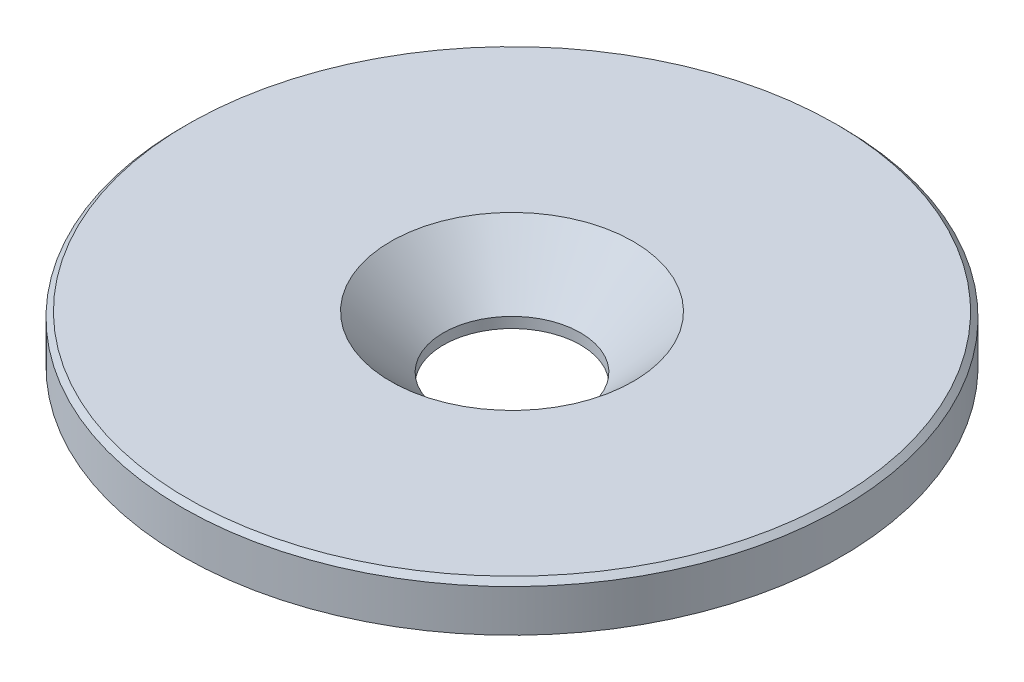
ISO-10303-21;
HEADER;
FILE_DESCRIPTION(('STEP AP214'),'2;1');
FILE_NAME('part.step','',(''),(''),'','','');
FILE_SCHEMA(('AUTOMOTIVE_DESIGN { 1 0 10303 214 1 1 1 1 }'));
ENDSEC;
DATA;
#1=APPLICATION_CONTEXT('core data for automotive mechanical design processes');
#2=APPLICATION_PROTOCOL_DEFINITION('international standard','automotive_design',2000,#1);
#3=PRODUCT_CONTEXT('',#1,'mechanical');
#4=PRODUCT('Part','Part','',(#3));
#5=PRODUCT_RELATED_PRODUCT_CATEGORY('part','',(#4));
#6=PRODUCT_DEFINITION_FORMATION('','',#4);
#7=PRODUCT_DEFINITION_CONTEXT('part definition',#1,'design');
#8=PRODUCT_DEFINITION('design','',#6,#7);
#9=PRODUCT_DEFINITION_SHAPE('','',#8);
#10=(LENGTH_UNIT() NAMED_UNIT(*) SI_UNIT(.MILLI.,.METRE.));
#11=(NAMED_UNIT(*) PLANE_ANGLE_UNIT() SI_UNIT($,.RADIAN.));
#12=(NAMED_UNIT(*) SI_UNIT($,.STERADIAN.) SOLID_ANGLE_UNIT());
#13=UNCERTAINTY_MEASURE_WITH_UNIT(LENGTH_MEASURE(1.E-05),#10,'distance_accuracy_value','');
#14=(GEOMETRIC_REPRESENTATION_CONTEXT(3) GLOBAL_UNCERTAINTY_ASSIGNED_CONTEXT((#13)) GLOBAL_UNIT_ASSIGNED_CONTEXT((#10,
#11,#12)) REPRESENTATION_CONTEXT('',''));
#15=CARTESIAN_POINT('',(0.,0.,0.));
#16=DIRECTION('',(0.,0.,1.));
#17=DIRECTION('',(1.,0.,0.));
#18=AXIS2_PLACEMENT_3D('',#15,#16,#17);
#19=CARTESIAN_POINT('',(0.,0.,0.));
#20=DIRECTION('',(0.,-1.,0.));
#21=DIRECTION('',(0.,0.,-1.));
#22=AXIS2_PLACEMENT_3D('',#19,#20,#21);
#23=CYLINDRICAL_SURFACE('',#22,13.);
#24=CARTESIAN_POINT('',(0.,2.,0.));
#25=DIRECTION('',(0.,-1.,0.));
#26=DIRECTION('',(0.,0.,-1.));
#27=AXIS2_PLACEMENT_3D('',#24,#25,#26);
#28=CIRCLE('',#27,13.);
#29=CARTESIAN_POINT('',(0.,2.,-13.));
#30=VERTEX_POINT('',#29);
#31=EDGE_CURVE('E34',#30,#30,#28,.T.);
#32=ORIENTED_EDGE('',*,*,#31,.F.);
#33=EDGE_LOOP('',(#32));
#34=FACE_BOUND('',#33,.T.);
#35=CARTESIAN_POINT('',(0.,0.,0.));
#36=DIRECTION('',(0.,-1.,0.));
#37=DIRECTION('',(0.,0.,-1.));
#38=AXIS2_PLACEMENT_3D('',#35,#36,#37);
#39=CIRCLE('',#38,13.);
#40=CARTESIAN_POINT('',(0.,0.,-13.));
#41=VERTEX_POINT('',#40);
#42=EDGE_CURVE('E46',#41,#41,#39,.T.);
#43=ORIENTED_EDGE('',*,*,#42,.T.);
#44=EDGE_LOOP('',(#43));
#45=FACE_BOUND('',#44,.T.);
#46=ADVANCED_FACE('F14',(#34,#45),#23,.F.);
#47=CARTESIAN_POINT('',(0.,2.,0.));
#48=DIRECTION('',(0.,1.,0.));
#49=DIRECTION('',(0.,0.,1.));
#50=AXIS2_PLACEMENT_3D('',#47,#48,#49);
#51=CONICAL_SURFACE('',#50,13.,0.78539816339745);
#52=CARTESIAN_POINT('',(0.,12.,0.));
#53=DIRECTION('',(0.,-1.,0.));
#54=DIRECTION('',(0.,0.,-1.));
#55=AXIS2_PLACEMENT_3D('',#52,#53,#54);
#56=CIRCLE('',#55,23.);
#57=CARTESIAN_POINT('',(0.,12.,-23.));
#58=VERTEX_POINT('',#57);
#59=EDGE_CURVE('E37',#58,#58,#56,.T.);
#60=ORIENTED_EDGE('',*,*,#59,.F.);
#61=EDGE_LOOP('',(#60));
#62=FACE_BOUND('',#61,.T.);
#63=ORIENTED_EDGE('',*,*,#31,.T.);
#64=EDGE_LOOP('',(#63));
#65=FACE_BOUND('',#64,.T.);
#66=ADVANCED_FACE('F68',(#62,#65),#51,.F.);
#67=CARTESIAN_POINT('',(-23.,12.,0.));
#68=DIRECTION('',(0.,-1.,0.));
#69=DIRECTION('',(0.,0.,-1.));
#70=AXIS2_PLACEMENT_3D('',#67,#68,#69);
#71=PLANE('',#70);
#72=CARTESIAN_POINT('',(0.,12.,0.));
#73=DIRECTION('',(0.,-1.,0.));
#74=DIRECTION('',(0.,0.,-1.));
#75=AXIS2_PLACEMENT_3D('',#72,#73,#74);
#76=CIRCLE('',#75,61.5);
#77=CARTESIAN_POINT('',(0.,12.,-61.5));
#78=VERTEX_POINT('',#77);
#79=EDGE_CURVE('E9',#78,#78,#76,.F.);
#80=ORIENTED_EDGE('',*,*,#79,.T.);
#81=EDGE_LOOP('',(#80));
#82=FACE_BOUND('',#81,.T.);
#83=ORIENTED_EDGE('',*,*,#59,.T.);
#84=EDGE_LOOP('',(#83));
#85=FACE_BOUND('',#84,.T.);
#86=ADVANCED_FACE('F75',(#82,#85),#71,.F.);
#87=CARTESIAN_POINT('',(0.,0.,0.));
#88=DIRECTION('',(0.,-1.,0.));
#89=DIRECTION('',(0.,0.,-1.));
#90=AXIS2_PLACEMENT_3D('',#87,#88,#89);
#91=CYLINDRICAL_SURFACE('',#90,62.5);
#92=CARTESIAN_POINT('',(0.,11.,0.));
#93=DIRECTION('',(0.,-1.,0.));
#94=DIRECTION('',(0.,0.,-1.));
#95=AXIS2_PLACEMENT_3D('',#92,#93,#94);
#96=CIRCLE('',#95,62.5);
#97=CARTESIAN_POINT('',(0.,11.,-62.5));
#98=VERTEX_POINT('',#97);
#99=EDGE_CURVE('E21',#98,#98,#96,.T.);
#100=ORIENTED_EDGE('',*,*,#99,.T.);
#101=EDGE_LOOP('',(#100));
#102=FACE_BOUND('',#101,.T.);
#103=CARTESIAN_POINT('',(0.,3.,0.));
#104=DIRECTION('',(0.,-1.,0.));
#105=DIRECTION('',(0.,0.,-1.));
#106=AXIS2_PLACEMENT_3D('',#103,#104,#105);
#107=CIRCLE('',#106,62.5);
#108=CARTESIAN_POINT('',(0.,3.,-62.5));
#109=VERTEX_POINT('',#108);
#110=EDGE_CURVE('E40',#109,#109,#107,.T.);
#111=ORIENTED_EDGE('',*,*,#110,.F.);
#112=EDGE_LOOP('',(#111));
#113=FACE_BOUND('',#112,.T.);
#114=ADVANCED_FACE('F82',(#102,#113),#91,.T.);
#115=CARTESIAN_POINT('',(-45.,3.,0.));
#116=DIRECTION('',(0.,1.,0.));
#117=DIRECTION('',(0.,0.,1.));
#118=AXIS2_PLACEMENT_3D('',#115,#116,#117);
#119=PLANE('',#118);
#120=CARTESIAN_POINT('',(0.,3.,0.));
#121=DIRECTION('',(0.,-1.,0.));
#122=DIRECTION('',(0.,0.,-1.));
#123=AXIS2_PLACEMENT_3D('',#120,#121,#122);
#124=CIRCLE('',#123,45.);
#125=CARTESIAN_POINT('',(0.,3.,-45.));
#126=VERTEX_POINT('',#125);
#127=EDGE_CURVE('E43',#126,#126,#124,.T.);
#128=ORIENTED_EDGE('',*,*,#127,.F.);
#129=EDGE_LOOP('',(#128));
#130=FACE_BOUND('',#129,.T.);
#131=ORIENTED_EDGE('',*,*,#110,.T.);
#132=EDGE_LOOP('',(#131));
#133=FACE_BOUND('',#132,.T.);
#134=ADVANCED_FACE('F64',(#130,#133),#119,.F.);
#135=CARTESIAN_POINT('',(0.,0.,0.));
#136=DIRECTION('',(0.,-1.,0.));
#137=DIRECTION('',(0.,0.,-1.));
#138=AXIS2_PLACEMENT_3D('',#135,#136,#137);
#139=CYLINDRICAL_SURFACE('',#138,45.);
#140=CARTESIAN_POINT('',(0.,1.00000000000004,0.));
#141=DIRECTION('',(0.,1.,0.));
#142=DIRECTION('',(0.,0.,1.));
#143=AXIS2_PLACEMENT_3D('',#140,#141,#142);
#144=CIRCLE('',#143,45.);
#145=CARTESIAN_POINT('',(0.,1.00000000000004,45.));
#146=VERTEX_POINT('',#145);
#147=EDGE_CURVE('E25',#146,#146,#144,.T.);
#148=ORIENTED_EDGE('',*,*,#147,.T.);
#149=EDGE_LOOP('',(#148));
#150=FACE_BOUND('',#149,.T.);
#151=ORIENTED_EDGE('',*,*,#127,.T.);
#152=EDGE_LOOP('',(#151));
#153=FACE_BOUND('',#152,.T.);
#154=ADVANCED_FACE('F54',(#150,#153),#139,.T.);
#155=CARTESIAN_POINT('',(-13.,0.,0.));
#156=DIRECTION('',(0.,1.,0.));
#157=DIRECTION('',(0.,0.,1.));
#158=AXIS2_PLACEMENT_3D('',#155,#156,#157);
#159=PLANE('',#158);
#160=CARTESIAN_POINT('',(0.,0.,0.));
#161=DIRECTION('',(0.,1.,0.));
#162=DIRECTION('',(0.,0.,1.));
#163=AXIS2_PLACEMENT_3D('',#160,#161,#162);
#164=CIRCLE('',#163,44.);
#165=CARTESIAN_POINT('',(0.,0.,44.));
#166=VERTEX_POINT('',#165);
#167=EDGE_CURVE('E29',#166,#166,#164,.F.);
#168=ORIENTED_EDGE('',*,*,#167,.T.);
#169=EDGE_LOOP('',(#168));
#170=FACE_BOUND('',#169,.T.);
#171=ORIENTED_EDGE('',*,*,#42,.F.);
#172=EDGE_LOOP('',(#171));
#173=FACE_BOUND('',#172,.T.);
#174=ADVANCED_FACE('F51',(#170,#173),#159,.F.);
#175=CARTESIAN_POINT('',(0.,0.,0.));
#176=DIRECTION('',(0.,1.,0.));
#177=DIRECTION('',(0.,0.,1.));
#178=AXIS2_PLACEMENT_3D('',#175,#176,#177);
#179=CONICAL_SURFACE('',#178,44.,0.785398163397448);
#180=ORIENTED_EDGE('',*,*,#147,.F.);
#181=EDGE_LOOP('',(#180));
#182=FACE_BOUND('',#181,.T.);
#183=ORIENTED_EDGE('',*,*,#167,.F.);
#184=EDGE_LOOP('',(#183));
#185=FACE_BOUND('',#184,.T.);
#186=ADVANCED_FACE('F53',(#182,#185),#179,.T.);
#187=CARTESIAN_POINT('',(0.,11.,0.));
#188=DIRECTION('',(0.,-1.,0.));
#189=DIRECTION('',(0.,0.,-1.));
#190=AXIS2_PLACEMENT_3D('',#187,#188,#189);
#191=CONICAL_SURFACE('',#190,62.5,0.785398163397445);
#192=ORIENTED_EDGE('',*,*,#79,.F.);
#193=EDGE_LOOP('',(#192));
#194=FACE_BOUND('',#193,.T.);
#195=ORIENTED_EDGE('',*,*,#99,.F.);
#196=EDGE_LOOP('',(#195));
#197=FACE_BOUND('',#196,.T.);
#198=ADVANCED_FACE('F16',(#194,#197),#191,.T.);
#199=CLOSED_SHELL('',(#46,#66,#86,#114,#134,#154,#174,#186,#198));
#200=MANIFOLD_SOLID_BREP('B1',#199);
#201=ADVANCED_BREP_SHAPE_REPRESENTATION('',(#18,#200),#14);
#202=SHAPE_DEFINITION_REPRESENTATION(#9,#201);
ENDSEC;
END-ISO-10303-21;
